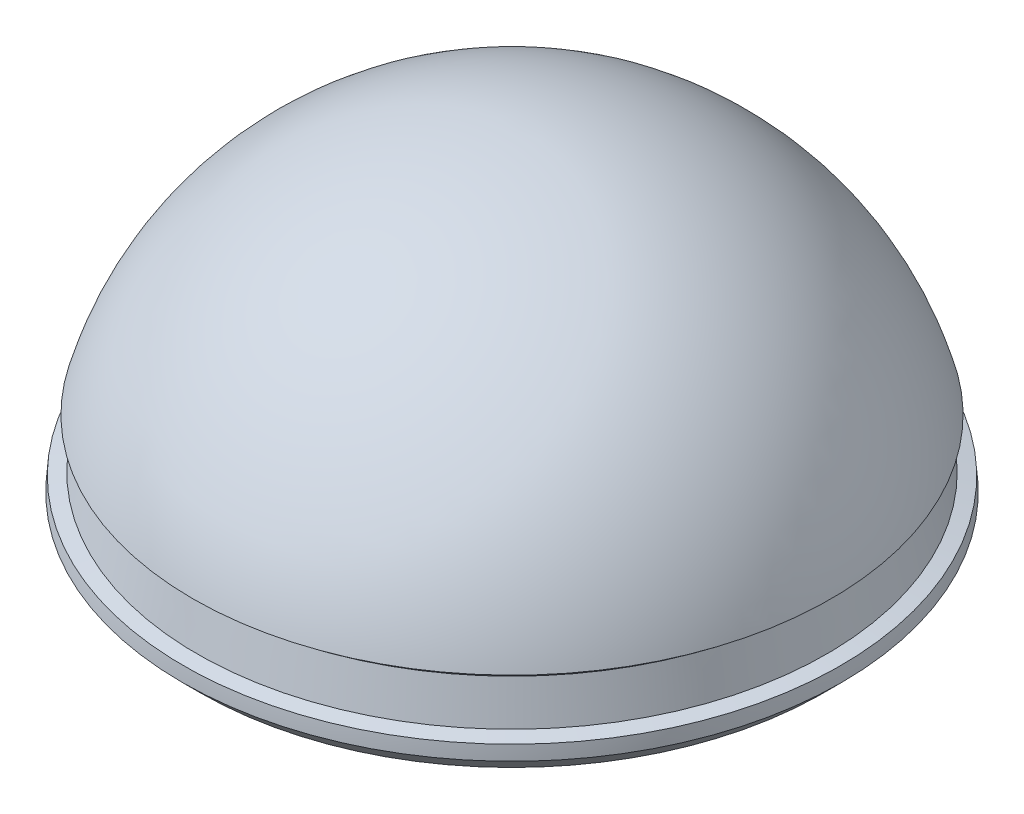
ISO-10303-21;
HEADER;
FILE_DESCRIPTION(('STEP AP214'),'2;1');
FILE_NAME('part.step','',(''),(''),'','','');
FILE_SCHEMA(('AUTOMOTIVE_DESIGN { 1 0 10303 214 1 1 1 1 }'));
ENDSEC;
DATA;
#1=APPLICATION_CONTEXT('core data for automotive mechanical design processes');
#2=APPLICATION_PROTOCOL_DEFINITION('international standard','automotive_design',2000,#1);
#3=PRODUCT_CONTEXT('',#1,'mechanical');
#4=PRODUCT('Part','Part','',(#3));
#5=PRODUCT_RELATED_PRODUCT_CATEGORY('part','',(#4));
#6=PRODUCT_DEFINITION_FORMATION('','',#4);
#7=PRODUCT_DEFINITION_CONTEXT('part definition',#1,'design');
#8=PRODUCT_DEFINITION('design','',#6,#7);
#9=PRODUCT_DEFINITION_SHAPE('','',#8);
#10=(LENGTH_UNIT() NAMED_UNIT(*) SI_UNIT(.MILLI.,.METRE.));
#11=(NAMED_UNIT(*) PLANE_ANGLE_UNIT() SI_UNIT($,.RADIAN.));
#12=(NAMED_UNIT(*) SI_UNIT($,.STERADIAN.) SOLID_ANGLE_UNIT());
#13=UNCERTAINTY_MEASURE_WITH_UNIT(LENGTH_MEASURE(1.E-05),#10,'distance_accuracy_value','');
#14=(GEOMETRIC_REPRESENTATION_CONTEXT(3) GLOBAL_UNCERTAINTY_ASSIGNED_CONTEXT((#13)) GLOBAL_UNIT_ASSIGNED_CONTEXT((#10,
#11,#12)) REPRESENTATION_CONTEXT('',''));
#15=CARTESIAN_POINT('',(0.,0.,0.));
#16=DIRECTION('',(0.,0.,1.));
#17=DIRECTION('',(1.,0.,0.));
#18=AXIS2_PLACEMENT_3D('',#15,#16,#17);
#19=CARTESIAN_POINT('',(0.,0.,0.));
#20=DIRECTION('',(0.,1.,0.));
#21=DIRECTION('',(0.,0.,-1.));
#22=AXIS2_PLACEMENT_3D('',#19,#20,#21);
#23=SPHERICAL_SURFACE('',#22,35.);
#24=CARTESIAN_POINT('',(0.,1.94586674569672,0.));
#25=DIRECTION('',(0.,-1.,0.));
#26=DIRECTION('',(0.,0.,-1.));
#27=AXIS2_PLACEMENT_3D('',#24,#25,#26);
#28=CIRCLE('',#27,34.9458667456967);
#29=CARTESIAN_POINT('',(0.,1.94586674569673,-34.9458667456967));
#30=VERTEX_POINT('',#29);
#31=EDGE_CURVE('E38',#30,#30,#28,.F.);
#32=CARTESIAN_POINT('',(0.,3.43316037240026,0.));
#33=DIRECTION('',(0.,1.,0.));
#34=DIRECTION('',(0.,0.,1.));
#35=AXIS2_PLACEMENT_3D('',#32,#33,#34);
#36=CIRCLE('',#35,34.8312131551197);
#37=CARTESIAN_POINT('',(0.,3.43316037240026,-34.8312131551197));
#38=VERTEX_POINT('',#37);
#39=EDGE_CURVE('E49',#38,#38,#36,.F.);
#40=CARTESIAN_POINT('',(0.,1.94586674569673,-34.9458667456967));
#41=CARTESIAN_POINT('',(0.,1.96138249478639,-34.9450027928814));
#42=CARTESIAN_POINT('',(0.,1.97689766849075,-34.944128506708));
#43=CARTESIAN_POINT('',(0.,2.00792683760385,-34.942359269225));
#44=CARTESIAN_POINT('',(0.,2.0234408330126,-34.9414643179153));
#45=CARTESIAN_POINT('',(0.,2.05446761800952,-34.9396537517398));
#46=CARTESIAN_POINT('',(0.,2.06998040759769,-34.938738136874));
#47=CARTESIAN_POINT('',(0.,2.10100475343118,-34.9368862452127));
#48=CARTESIAN_POINT('',(0.,2.1165163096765,-34.9359499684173));
#49=CARTESIAN_POINT('',(0.,2.14753816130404,-34.9340567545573));
#50=CARTESIAN_POINT('',(0.,2.16304845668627,-34.9330998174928));
#51=CARTESIAN_POINT('',(0.,2.19406775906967,-34.9311652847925));
#52=CARTESIAN_POINT('',(0.,2.20957676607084,-34.9301876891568));
#53=CARTESIAN_POINT('',(0.,2.24059346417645,-34.9282118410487));
#54=CARTESIAN_POINT('',(0.,2.25610115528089,-34.9272135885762));
#55=CARTESIAN_POINT('',(0.,2.28711519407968,-34.9251964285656));
#56=CARTESIAN_POINT('',(0.,2.30262154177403,-34.9241775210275));
#57=CARTESIAN_POINT('',(0.,2.33363286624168,-34.9221190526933));
#58=CARTESIAN_POINT('',(0.,2.34913784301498,-34.9210794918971));
#59=CARTESIAN_POINT('',(0.,2.38014639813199,-34.9189797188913));
#60=CARTESIAN_POINT('',(0.,2.39564997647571,-34.9179195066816));
#61=CARTESIAN_POINT('',(0.,2.42665570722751,-34.9157784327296));
#62=CARTESIAN_POINT('',(0.,2.44215785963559,-34.9146975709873));
#63=CARTESIAN_POINT('',(0.,2.47316071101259,-34.9125151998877));
#64=CARTESIAN_POINT('',(0.,2.48866140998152,-34.9114136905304));
#65=CARTESIAN_POINT('',(0.,2.51966132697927,-34.9091900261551));
#66=CARTESIAN_POINT('',(0.,2.53516054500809,-34.9080678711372));
#67=CARTESIAN_POINT('',(0.,2.56615747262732,-34.9058029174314));
#68=CARTESIAN_POINT('',(0.,2.58165518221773,-34.9046601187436));
#69=CARTESIAN_POINT('',(0.,2.61264906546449,-34.9023538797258));
#70=CARTESIAN_POINT('',(0.,2.62814523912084,-34.9011904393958));
#71=CARTESIAN_POINT('',(0.,2.65913602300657,-34.8988429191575));
#72=CARTESIAN_POINT('',(0.,2.67463063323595,-34.8976588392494));
#73=CARTESIAN_POINT('',(0.,2.7056182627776,-34.8952700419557));
#74=CARTESIAN_POINT('',(0.,2.72111128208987,-34.8940653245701));
#75=CARTESIAN_POINT('',(0.,2.75209570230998,-34.8916352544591));
#76=CARTESIAN_POINT('',(0.,2.76758710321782,-34.8904099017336));
#77=CARTESIAN_POINT('',(0.,2.79856825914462,-34.8879385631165));
#78=CARTESIAN_POINT('',(0.,2.81405801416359,-34.886692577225));
#79=CARTESIAN_POINT('',(0.,2.84503585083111,-34.8841799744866));
#80=CARTESIAN_POINT('',(0.,2.86052393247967,-34.8829133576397));
#81=CARTESIAN_POINT('',(0.,2.89149839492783,-34.8803594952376));
#82=CARTESIAN_POINT('',(0.,2.90698477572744,-34.8790722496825));
#83=CARTESIAN_POINT('',(0.,2.93795580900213,-34.8764771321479));
#84=CARTESIAN_POINT('',(0.,2.95344046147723,-34.8751692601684));
#85=CARTESIAN_POINT('',(0.,2.98440801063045,-34.8725328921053));
#86=CARTESIAN_POINT('',(0.,2.99989090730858,-34.8712043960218));
#87=CARTESIAN_POINT('',(0.,3.03085491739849,-34.8685267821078));
#88=CARTESIAN_POINT('',(0.,3.04633603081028,-34.8671776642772));
#89=CARTESIAN_POINT('',(0.,3.07729644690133,-34.8644588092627));
#90=CARTESIAN_POINT('',(0.,3.09277574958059,-34.8630890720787));
#91=CARTESIAN_POINT('',(0.,3.1237325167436,-34.8603289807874));
#92=CARTESIAN_POINT('',(0.,3.13920998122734,-34.8589386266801));
#93=CARTESIAN_POINT('',(0.,3.17016304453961,-34.8561373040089));
#94=CARTESIAN_POINT('',(0.,3.18563864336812,-34.854726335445));
#95=CARTESIAN_POINT('',(0.,3.21658794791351,-34.851883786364));
#96=CARTESIAN_POINT('',(0.,3.23206165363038,-34.8504522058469));
#97=CARTESIAN_POINT('',(0.,3.26300714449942,-34.8475684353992));
#98=CARTESIAN_POINT('',(0.,3.27847892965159,-34.8461162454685));
#99=CARTESIAN_POINT('',(0.,3.30942055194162,-34.8431912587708));
#100=CARTESIAN_POINT('',(0.,3.32489038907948,-34.8417184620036));
#101=CARTESIAN_POINT('',(0.,3.35582808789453,-34.8387522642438));
#102=CARTESIAN_POINT('',(0.,3.3712959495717,-34.837258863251));
#103=CARTESIAN_POINT('',(0.,3.40222967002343,-34.8342514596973));
#104=CARTESIAN_POINT('',(0.,3.41769552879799,-34.8327374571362));
#105=CARTESIAN_POINT('',(0.,3.43316037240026,-34.8312131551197));
#106=B_SPLINE_CURVE_WITH_KNOTS('',3,(#40,#41,#42,#43,#44,#45,#46,#47,#48,#49,#50,#51,#52,#53,
#54,#55,#56,#57,#58,#59,#60,#61,#62,#63,#64,#65,#66,#67,#68,#69,#70,#71,#72,#73,#74,#75,#76,#77,
#78,#79,#80,#81,#82,#83,#84,#85,#86,#87,#88,#89,#90,#91,#92,#93,#94,#95,#96,#97,#98,#99,#100,
#101,#102,#103,#104,#105),.UNSPECIFIED.,.F.,.F.,(4,2,2,2,2,2,2,2,2,2,2,2,2,2,2,2,2,2,2,2,2,2,2,
2,2,2,2,2,2,2,2,2,4),(0.,0.0466193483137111,0.0932386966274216,0.139858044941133,
0.186477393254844,0.233096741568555,0.279716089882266,0.326335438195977,0.372954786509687,
0.419574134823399,0.46619348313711,0.51281283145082,0.559432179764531,0.606051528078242,
0.652670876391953,0.699290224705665,0.745909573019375,0.792528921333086,0.839148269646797,
0.885767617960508,0.932386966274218,0.97900631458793,1.02562566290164,1.07224501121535,
1.11886435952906,1.16548370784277,1.21210305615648,1.2587224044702,1.30534175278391,
1.35196110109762,1.39858044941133,1.44519979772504,1.49181914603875),.UNSPECIFIED.);
#107=EDGE_CURVE('BSEAM31',#30,#38,#106,.T.);
#108=ORIENTED_EDGE('',*,*,#31,.T.);
#109=ORIENTED_EDGE('',*,*,#39,.T.);
#110=ORIENTED_EDGE('',*,*,#107,.T.);
#111=ORIENTED_EDGE('',*,*,#107,.F.);
#112=EDGE_LOOP('',(#108,#110,#109,#111));
#113=FACE_BOUND('',#112,.T.);
#114=ADVANCED_FACE('F31',(#113),#23,.T.);
#115=CARTESIAN_POINT('',(0.,0.,-35.));
#116=DIRECTION('',(0.,1.,0.));
#117=DIRECTION('',(0.,0.,1.));
#118=AXIS2_PLACEMENT_3D('',#115,#116,#117);
#119=PLANE('',#118);
#120=CARTESIAN_POINT('',(0.,0.,0.));
#121=DIRECTION('',(0.,1.,0.));
#122=DIRECTION('',(0.,0.,1.));
#123=AXIS2_PLACEMENT_3D('',#120,#121,#122);
#124=CIRCLE('',#123,33.);
#125=CARTESIAN_POINT('',(0.,0.,33.));
#126=VERTEX_POINT('',#125);
#127=EDGE_CURVE('E10',#126,#126,#124,.F.);
#128=ORIENTED_EDGE('',*,*,#127,.T.);
#129=EDGE_LOOP('',(#128));
#130=FACE_BOUND('',#129,.T.);
#131=CARTESIAN_POINT('',(0.,0.,0.));
#132=DIRECTION('',(0.,1.,0.));
#133=DIRECTION('',(0.,0.,1.));
#134=AXIS2_PLACEMENT_3D('',#131,#132,#133);
#135=CIRCLE('',#134,31.);
#136=CARTESIAN_POINT('',(0.,0.,31.));
#137=VERTEX_POINT('',#136);
#138=EDGE_CURVE('E42',#137,#137,#135,.T.);
#139=ORIENTED_EDGE('',*,*,#138,.T.);
#140=EDGE_LOOP('',(#139));
#141=FACE_BOUND('',#140,.T.);
#142=ADVANCED_FACE('F96',(#130,#141),#119,.F.);
#143=CARTESIAN_POINT('',(0.,0.,0.));
#144=DIRECTION('',(0.,1.,0.));
#145=DIRECTION('',(0.,0.,-1.));
#146=AXIS2_PLACEMENT_3D('',#143,#144,#145);
#147=SPHERICAL_SURFACE('',#146,31.);
#148=ORIENTED_EDGE('',*,*,#138,.F.);
#149=EDGE_LOOP('',(#148));
#150=FACE_BOUND('',#149,.T.);
#151=CARTESIAN_POINT('',(0.,30.4138126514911,0.));
#152=DIRECTION('',(0.,1.,0.));
#153=DIRECTION('',(0.,0.,1.));
#154=AXIS2_PLACEMENT_3D('',#151,#152,#153);
#155=CIRCLE('',#154,6.);
#156=CARTESIAN_POINT('',(0.,30.4138126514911,6.));
#157=VERTEX_POINT('',#156);
#158=EDGE_CURVE('E46',#157,#157,#155,.T.);
#159=ORIENTED_EDGE('',*,*,#158,.T.);
#160=EDGE_LOOP('',(#159));
#161=FACE_BOUND('',#160,.T.);
#162=ADVANCED_FACE('F90',(#150,#161),#147,.F.);
#163=CARTESIAN_POINT('',(0.,35.,0.));
#164=DIRECTION('',(0.,1.,0.));
#165=DIRECTION('',(0.,0.,1.));
#166=AXIS2_PLACEMENT_3D('',#163,#164,#165);
#167=CYLINDRICAL_SURFACE('',#166,6.);
#168=ORIENTED_EDGE('',*,*,#158,.F.);
#169=EDGE_LOOP('',(#168));
#170=FACE_BOUND('',#169,.T.);
#171=CARTESIAN_POINT('',(0.,18.,0.));
#172=DIRECTION('',(0.,1.,0.));
#173=DIRECTION('',(0.,0.,1.));
#174=AXIS2_PLACEMENT_3D('',#171,#172,#173);
#175=CIRCLE('',#174,6.);
#176=CARTESIAN_POINT('',(0.,18.,6.));
#177=VERTEX_POINT('',#176);
#178=EDGE_CURVE('E52',#177,#177,#175,.T.);
#179=ORIENTED_EDGE('',*,*,#178,.T.);
#180=EDGE_LOOP('',(#179));
#181=FACE_BOUND('',#180,.T.);
#182=ADVANCED_FACE('F85',(#170,#181),#167,.T.);
#183=CARTESIAN_POINT('',(0.,18.,0.));
#184=DIRECTION('',(0.,1.,0.));
#185=DIRECTION('',(0.,0.,1.));
#186=AXIS2_PLACEMENT_3D('',#183,#184,#185);
#187=PLANE('',#186);
#188=CARTESIAN_POINT('',(0.,18.,0.));
#189=DIRECTION('',(0.,-1.,0.));
#190=DIRECTION('',(0.,0.,-1.));
#191=AXIS2_PLACEMENT_3D('',#188,#189,#190);
#192=CIRCLE('',#191,2.75);
#193=CARTESIAN_POINT('',(0.,18.,-2.75));
#194=VERTEX_POINT('',#193);
#195=EDGE_CURVE('E67',#194,#194,#192,.T.);
#196=ORIENTED_EDGE('',*,*,#195,.F.);
#197=EDGE_LOOP('',(#196));
#198=FACE_BOUND('',#197,.T.);
#199=ORIENTED_EDGE('',*,*,#178,.F.);
#200=EDGE_LOOP('',(#199));
#201=FACE_BOUND('',#200,.T.);
#202=ADVANCED_FACE('F81',(#198,#201),#187,.F.);
#203=CARTESIAN_POINT('',(0.,3.76949775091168,0.));
#204=DIRECTION('',(0.,-1.,0.));
#205=DIRECTION('',(0.,0.,-1.));
#206=AXIS2_PLACEMENT_3D('',#203,#204,#205);
#207=CONICAL_SURFACE('',#206,33.3679141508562,1.34487163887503);
#208=CARTESIAN_POINT('',(0.,3.76949775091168,0.));
#209=DIRECTION('',(0.,-1.,0.));
#210=DIRECTION('',(0.,0.,-1.));
#211=AXIS2_PLACEMENT_3D('',#208,#209,#210);
#212=CIRCLE('',#211,33.3679141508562);
#213=CARTESIAN_POINT('',(0.,3.76949775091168,-33.3679141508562));
#214=VERTEX_POINT('',#213);
#215=EDGE_CURVE('E63',#214,#214,#212,.T.);
#216=ORIENTED_EDGE('',*,*,#215,.T.);
#217=EDGE_LOOP('',(#216));
#218=FACE_BOUND('',#217,.T.);
#219=ORIENTED_EDGE('',*,*,#39,.F.);
#220=EDGE_LOOP('',(#219));
#221=FACE_BOUND('',#220,.T.);
#222=ADVANCED_FACE('F84',(#218,#221),#207,.T.);
#223=CARTESIAN_POINT('',(0.,11.7738120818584,0.));
#224=DIRECTION('',(0.,1.,0.));
#225=DIRECTION('',(0.,0.,1.));
#226=AXIS2_PLACEMENT_3D('',#223,#224,#225);
#227=CONICAL_SURFACE('',#226,37.2917230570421,0.906866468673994);
#228=CARTESIAN_POINT('',(0.,8.02433749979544,0.));
#229=DIRECTION('',(0.,-1.,0.));
#230=DIRECTION('',(0.,0.,-1.));
#231=AXIS2_PLACEMENT_3D('',#228,#229,#230);
#232=CIRCLE('',#231,32.4995795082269);
#233=CARTESIAN_POINT('',(0.,8.02433749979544,-32.4995795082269));
#234=VERTEX_POINT('',#233);
#235=EDGE_CURVE('E55',#234,#234,#232,.T.);
#236=ORIENTED_EDGE('',*,*,#235,.F.);
#237=EDGE_LOOP('',(#236));
#238=FACE_BOUND('',#237,.T.);
#239=CARTESIAN_POINT('',(0.,9.04952293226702,0.));
#240=DIRECTION('',(0.,-1.,0.));
#241=DIRECTION('',(0.,0.,-1.));
#242=AXIS2_PLACEMENT_3D('',#239,#240,#241);
#243=CIRCLE('',#242,33.8098526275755);
#244=CARTESIAN_POINT('',(0.,9.04952293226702,-33.8098526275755));
#245=VERTEX_POINT('',#244);
#246=EDGE_CURVE('E53',#245,#245,#243,.F.);
#247=ORIENTED_EDGE('',*,*,#246,.F.);
#248=EDGE_LOOP('',(#247));
#249=FACE_BOUND('',#248,.T.);
#250=ADVANCED_FACE('F115',(#238,#249),#227,.T.);
#251=CARTESIAN_POINT('',(0.,8.02433749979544,0.));
#252=DIRECTION('',(0.,-1.,0.));
#253=DIRECTION('',(0.,0.,-1.));
#254=AXIS2_PLACEMENT_3D('',#251,#252,#253);
#255=CONICAL_SURFACE('',#254,32.4995795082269,0.201317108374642);
#256=ORIENTED_EDGE('',*,*,#215,.F.);
#257=EDGE_LOOP('',(#256));
#258=FACE_BOUND('',#257,.T.);
#259=ORIENTED_EDGE('',*,*,#235,.T.);
#260=EDGE_LOOP('',(#259));
#261=FACE_BOUND('',#260,.T.);
#262=ADVANCED_FACE('F108',(#258,#261),#255,.T.);
#263=ORIENTED_EDGE('',*,*,#246,.T.);
#264=EDGE_LOOP('',(#263));
#265=FACE_BOUND('',#264,.T.);
#266=ADVANCED_FACE('F101',(#265),#23,.T.);
#267=CARTESIAN_POINT('',(0.,1.94586674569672,0.));
#268=DIRECTION('',(0.,1.,0.));
#269=DIRECTION('',(0.,0.,1.));
#270=AXIS2_PLACEMENT_3D('',#267,#268,#269);
#271=CONICAL_SURFACE('',#270,34.9458667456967,0.785398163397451);
#272=ORIENTED_EDGE('',*,*,#127,.F.);
#273=EDGE_LOOP('',(#272));
#274=FACE_BOUND('',#273,.T.);
#275=ORIENTED_EDGE('',*,*,#31,.F.);
#276=EDGE_LOOP('',(#275));
#277=FACE_BOUND('',#276,.T.);
#278=ADVANCED_FACE('F33',(#274,#277),#271,.T.);
#279=CARTESIAN_POINT('',(0.,24.,0.));
#280=DIRECTION('',(0.,-1.,0.));
#281=DIRECTION('',(0.,0.,-1.));
#282=AXIS2_PLACEMENT_3D('',#279,#280,#281);
#283=CYLINDRICAL_SURFACE('',#282,2.75);
#284=CARTESIAN_POINT('',(0.,24.,0.));
#285=DIRECTION('',(0.,-1.,0.));
#286=DIRECTION('',(0.,0.,-1.));
#287=AXIS2_PLACEMENT_3D('',#284,#285,#286);
#288=CIRCLE('',#287,2.75);
#289=CARTESIAN_POINT('',(0.,24.,-2.75));
#290=VERTEX_POINT('',#289);
#291=EDGE_CURVE('E66',#290,#290,#288,.T.);
#292=ORIENTED_EDGE('',*,*,#291,.F.);
#293=EDGE_LOOP('',(#292));
#294=FACE_BOUND('',#293,.T.);
#295=ORIENTED_EDGE('',*,*,#195,.T.);
#296=EDGE_LOOP('',(#295));
#297=FACE_BOUND('',#296,.T.);
#298=ADVANCED_FACE('F75',(#294,#297),#283,.F.);
#299=CARTESIAN_POINT('',(0.,24.,0.));
#300=DIRECTION('',(0.,-1.,0.));
#301=DIRECTION('',(0.,0.,-1.));
#302=AXIS2_PLACEMENT_3D('',#299,#300,#301);
#303=PLANE('',#302);
#304=ORIENTED_EDGE('',*,*,#291,.T.);
#305=EDGE_LOOP('',(#304));
#306=FACE_BOUND('',#305,.T.);
#307=ADVANCED_FACE('F73',(#306),#303,.T.);
#308=CLOSED_SHELL('',(#114,#142,#162,#182,#202,#222,#250,#262,#266,#278,#298,#307));
#309=MANIFOLD_SOLID_BREP('B2',#308);
#310=ADVANCED_BREP_SHAPE_REPRESENTATION('',(#18,#309),#14);
#311=SHAPE_DEFINITION_REPRESENTATION(#9,#310);
ENDSEC;
END-ISO-10303-21;
